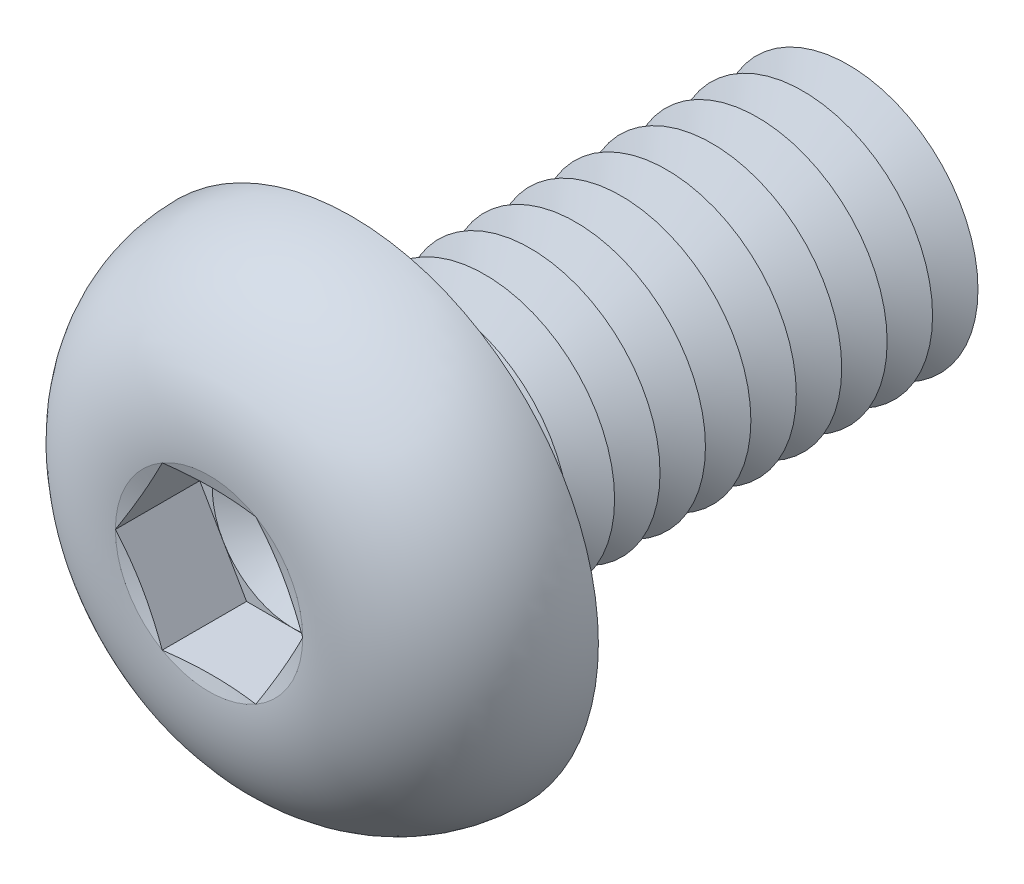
ISO-10303-21;
HEADER;
FILE_DESCRIPTION(('STEP AP214'),'2;1');
FILE_NAME('part.step','',(''),(''),'','','');
FILE_SCHEMA(('AUTOMOTIVE_DESIGN { 1 0 10303 214 1 1 1 1 }'));
ENDSEC;
DATA;
#1=APPLICATION_CONTEXT('core data for automotive mechanical design processes');
#2=APPLICATION_PROTOCOL_DEFINITION('international standard','automotive_design',2000,#1);
#3=PRODUCT_CONTEXT('',#1,'mechanical');
#4=PRODUCT('Part','Part','',(#3));
#5=PRODUCT_RELATED_PRODUCT_CATEGORY('part','',(#4));
#6=PRODUCT_DEFINITION_FORMATION('','',#4);
#7=PRODUCT_DEFINITION_CONTEXT('part definition',#1,'design');
#8=PRODUCT_DEFINITION('design','',#6,#7);
#9=PRODUCT_DEFINITION_SHAPE('','',#8);
#10=(LENGTH_UNIT() NAMED_UNIT(*) SI_UNIT(.MILLI.,.METRE.));
#11=(NAMED_UNIT(*) PLANE_ANGLE_UNIT() SI_UNIT($,.RADIAN.));
#12=(NAMED_UNIT(*) SI_UNIT($,.STERADIAN.) SOLID_ANGLE_UNIT());
#13=UNCERTAINTY_MEASURE_WITH_UNIT(LENGTH_MEASURE(1.E-05),#10,'distance_accuracy_value','');
#14=(GEOMETRIC_REPRESENTATION_CONTEXT(3) GLOBAL_UNCERTAINTY_ASSIGNED_CONTEXT((#13)) GLOBAL_UNIT_ASSIGNED_CONTEXT((#10,
#11,#12)) REPRESENTATION_CONTEXT('',''));
#15=CARTESIAN_POINT('',(0.,0.,0.));
#16=DIRECTION('',(0.,0.,1.));
#17=DIRECTION('',(1.,0.,0.));
#18=AXIS2_PLACEMENT_3D('',#15,#16,#17);
#19=CARTESIAN_POINT('',(0.,0.,0.9));
#20=DIRECTION('',(0.,0.,1.));
#21=DIRECTION('',(1.,0.,0.));
#22=AXIS2_PLACEMENT_3D('',#19,#20,#21);
#23=PLANE('',#22);
#24=CARTESIAN_POINT('',(0.,0.,0.9));
#25=DIRECTION('',(0.,0.,1.));
#26=DIRECTION('',(1.,0.,0.));
#27=AXIS2_PLACEMENT_3D('',#24,#25,#26);
#28=CIRCLE('',#27,1.24999941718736);
#29=CARTESIAN_POINT('',(1.08253125,0.624999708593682,0.9));
#30=VERTEX_POINT('',#29);
#31=CARTESIAN_POINT('',(0.,1.24999941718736,0.9));
#32=VERTEX_POINT('',#31);
#33=EDGE_CURVE('E118',#30,#32,#28,.T.);
#34=ORIENTED_EDGE('',*,*,#33,.F.);
#35=DIRECTION('',(-0.5,0.866025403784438,0.));
#36=VECTOR('',#35,1.);
#37=CARTESIAN_POINT('',(1.443375,0.,0.9));
#38=LINE('',#37,#36);
#39=CARTESIAN_POINT('',(0.7216875,1.24999941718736,0.9));
#40=VERTEX_POINT('',#39);
#41=EDGE_CURVE('E125',#30,#40,#38,.T.);
#42=ORIENTED_EDGE('',*,*,#41,.T.);
#43=DIRECTION('',(-1.,0.,0.));
#44=VECTOR('',#43,1.);
#45=CARTESIAN_POINT('',(0.7216875,1.24999941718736,0.9));
#46=LINE('',#45,#44);
#47=EDGE_CURVE('E136',#40,#32,#46,.T.);
#48=ORIENTED_EDGE('',*,*,#47,.T.);
#49=EDGE_LOOP('',(#34,#42,#48));
#50=FACE_BOUND('',#49,.T.);
#51=ADVANCED_FACE('F39',(#50),#23,.T.);
#52=CARTESIAN_POINT('',(0.,0.,0.9));
#53=DIRECTION('',(0.,0.,1.));
#54=DIRECTION('',(1.,0.,0.));
#55=AXIS2_PLACEMENT_3D('',#52,#53,#54);
#56=CIRCLE('',#55,1.24999941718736);
#57=CARTESIAN_POINT('',(-1.08253125,0.624999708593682,0.9));
#58=VERTEX_POINT('',#57);
#59=EDGE_CURVE('E11',#32,#58,#56,.T.);
#60=ORIENTED_EDGE('',*,*,#59,.F.);
#61=CARTESIAN_POINT('',(-0.721687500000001,1.24999941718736,0.9));
#62=VERTEX_POINT('',#61);
#63=EDGE_CURVE('E131',#32,#62,#46,.T.);
#64=ORIENTED_EDGE('',*,*,#63,.T.);
#65=DIRECTION('',(-0.5,-0.866025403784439,0.));
#66=VECTOR('',#65,1.);
#67=CARTESIAN_POINT('',(-0.721687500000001,1.24999941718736,0.9));
#68=LINE('',#67,#66);
#69=EDGE_CURVE('E134',#62,#58,#68,.T.);
#70=ORIENTED_EDGE('',*,*,#69,.T.);
#71=EDGE_LOOP('',(#60,#64,#70));
#72=FACE_BOUND('',#71,.T.);
#73=ADVANCED_FACE('F130',(#72),#23,.T.);
#74=CARTESIAN_POINT('',(-1.08253125,-0.624999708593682,0.9));
#75=VERTEX_POINT('',#74);
#76=EDGE_CURVE('E49',#58,#75,#56,.T.);
#77=ORIENTED_EDGE('',*,*,#76,.F.);
#78=CARTESIAN_POINT('',(-1.443375,0.,0.9));
#79=VERTEX_POINT('',#78);
#80=EDGE_CURVE('E143',#58,#79,#68,.T.);
#81=ORIENTED_EDGE('',*,*,#80,.T.);
#82=DIRECTION('',(0.5,-0.866025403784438,0.));
#83=VECTOR('',#82,1.);
#84=CARTESIAN_POINT('',(-1.443375,0.,0.9));
#85=LINE('',#84,#83);
#86=EDGE_CURVE('E152',#79,#75,#85,.T.);
#87=ORIENTED_EDGE('',*,*,#86,.T.);
#88=EDGE_LOOP('',(#77,#81,#87));
#89=FACE_BOUND('',#88,.T.);
#90=ADVANCED_FACE('F360',(#89),#23,.T.);
#91=CARTESIAN_POINT('',(0.,-1.24999941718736,0.9));
#92=VERTEX_POINT('',#91);
#93=EDGE_CURVE('E345',#75,#92,#56,.T.);
#94=ORIENTED_EDGE('',*,*,#93,.F.);
#95=CARTESIAN_POINT('',(-0.721687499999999,-1.24999941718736,0.9));
#96=VERTEX_POINT('',#95);
#97=EDGE_CURVE('E151',#75,#96,#85,.T.);
#98=ORIENTED_EDGE('',*,*,#97,.T.);
#99=DIRECTION('',(1.,0.,0.));
#100=VECTOR('',#99,1.);
#101=CARTESIAN_POINT('',(-0.721687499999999,-1.24999941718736,0.9));
#102=LINE('',#101,#100);
#103=EDGE_CURVE('E157',#96,#92,#102,.T.);
#104=ORIENTED_EDGE('',*,*,#103,.T.);
#105=EDGE_LOOP('',(#94,#98,#104));
#106=FACE_BOUND('',#105,.T.);
#107=ADVANCED_FACE('F353',(#106),#23,.T.);
#108=CARTESIAN_POINT('',(1.08253125,-0.624999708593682,0.9));
#109=VERTEX_POINT('',#108);
#110=EDGE_CURVE('E56',#92,#109,#56,.T.);
#111=ORIENTED_EDGE('',*,*,#110,.F.);
#112=CARTESIAN_POINT('',(0.721687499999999,-1.24999941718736,0.9));
#113=VERTEX_POINT('',#112);
#114=EDGE_CURVE('E156',#92,#113,#102,.T.);
#115=ORIENTED_EDGE('',*,*,#114,.T.);
#116=DIRECTION('',(0.5,0.866025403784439,0.));
#117=VECTOR('',#116,1.);
#118=CARTESIAN_POINT('',(0.721687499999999,-1.24999941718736,0.9));
#119=LINE('',#118,#117);
#120=EDGE_CURVE('E162',#113,#109,#119,.T.);
#121=ORIENTED_EDGE('',*,*,#120,.T.);
#122=EDGE_LOOP('',(#111,#115,#121));
#123=FACE_BOUND('',#122,.T.);
#124=ADVANCED_FACE('F421',(#123),#23,.T.);
#125=CARTESIAN_POINT('',(0.,0.,2.2));
#126=DIRECTION('',(0.,0.,1.));
#127=DIRECTION('',(1.,0.,0.));
#128=AXIS2_PLACEMENT_3D('',#125,#126,#127);
#129=CONICAL_SURFACE('',#128,1.443375,1.30899693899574);
#130=CARTESIAN_POINT('',(1.44349047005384,-0.000199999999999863,2.20003094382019));
#131=CARTESIAN_POINT('',(1.41351104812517,0.0517258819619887,2.19199301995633));
#132=CARTESIAN_POINT('',(1.38347725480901,0.10374593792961,2.18469579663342));
#133=CARTESIAN_POINT('',(1.32330355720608,0.207969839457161,2.17187512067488));
#134=CARTESIAN_POINT('',(1.29316361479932,0.260173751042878,2.16635238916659));
#135=CARTESIAN_POINT('',(1.23296043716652,0.364448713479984,2.15740323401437));
#136=CARTESIAN_POINT('',(1.20289760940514,0.416519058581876,2.15396613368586));
#137=CARTESIAN_POINT('',(1.14273359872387,0.520726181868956,2.14935732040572));
#138=CARTESIAN_POINT('',(1.11263242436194,0.572862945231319,2.14818516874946));
#139=CARTESIAN_POINT('',(1.05243007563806,0.677136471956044,2.14818516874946));
#140=CARTESIAN_POINT('',(1.02232890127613,0.729273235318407,2.14935732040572));
#141=CARTESIAN_POINT('',(0.962164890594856,0.833480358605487,2.15396613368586));
#142=CARTESIAN_POINT('',(0.932102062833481,0.885550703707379,2.15740323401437));
#143=CARTESIAN_POINT('',(0.87189888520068,0.989825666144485,2.16635238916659));
#144=CARTESIAN_POINT('',(0.841758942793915,1.0420295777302,2.17187512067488));
#145=CARTESIAN_POINT('',(0.781585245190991,1.14625347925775,2.18469579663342));
#146=CARTESIAN_POINT('',(0.751551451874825,1.19827353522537,2.19199301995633));
#147=CARTESIAN_POINT('',(0.721572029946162,1.25019941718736,2.20003094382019));
#148=B_SPLINE_CURVE_WITH_KNOTS('',3,(#130,#131,#132,#133,#134,#135,#136,#137,#138,#139,#140,
#141,#142,#143,#144,#145,#146,#147),.UNSPECIFIED.,.F.,.F.,(4,2,2,2,2,2,2,2,4),(0.,
0.181495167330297,0.363063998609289,0.543695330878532,0.724291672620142,0.904888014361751,
1.08551934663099,1.26708817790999,1.44858334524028),.UNSPECIFIED.);
#149=CARTESIAN_POINT('',(1.443375,0.,2.2));
#150=VERTEX_POINT('',#149);
#151=CARTESIAN_POINT('',(0.721687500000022,1.24999941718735,2.2));
#152=VERTEX_POINT('',#151);
#153=EDGE_CURVE('E222',#150,#152,#148,.T.);
#154=ORIENTED_EDGE('',*,*,#153,.F.);
#155=CARTESIAN_POINT('',(0.,0.,2.2));
#156=DIRECTION('',(0.,0.,-1.));
#157=DIRECTION('',(-1.,0.,0.));
#158=AXIS2_PLACEMENT_3D('',#155,#156,#157);
#159=CIRCLE('',#158,1.443375);
#160=EDGE_CURVE('E390',#152,#150,#159,.T.);
#161=ORIENTED_EDGE('',*,*,#160,.F.);
#162=EDGE_LOOP('',(#154,#161));
#163=FACE_BOUND('',#162,.T.);
#164=ADVANCED_FACE('F410',(#163),#129,.F.);
#165=CARTESIAN_POINT('',(0.721572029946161,-1.25019941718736,2.20003094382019));
#166=CARTESIAN_POINT('',(0.751551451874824,-1.19827353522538,2.19199301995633));
#167=CARTESIAN_POINT('',(0.78158524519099,-1.14625347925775,2.18469579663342));
#168=CARTESIAN_POINT('',(0.841758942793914,-1.0420295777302,2.17187512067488));
#169=CARTESIAN_POINT('',(0.87189888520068,-0.989825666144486,2.16635238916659));
#170=CARTESIAN_POINT('',(0.932102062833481,-0.88555070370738,2.15740323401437));
#171=CARTESIAN_POINT('',(0.962164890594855,-0.833480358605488,2.15396613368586));
#172=CARTESIAN_POINT('',(1.02232890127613,-0.729273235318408,2.14935732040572));
#173=CARTESIAN_POINT('',(1.05243007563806,-0.677136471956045,2.14818516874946));
#174=CARTESIAN_POINT('',(1.11263242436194,-0.572862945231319,2.14818516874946));
#175=CARTESIAN_POINT('',(1.14273359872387,-0.520726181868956,2.14935732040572));
#176=CARTESIAN_POINT('',(1.20289760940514,-0.416519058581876,2.15396613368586));
#177=CARTESIAN_POINT('',(1.23296043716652,-0.364448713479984,2.15740323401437));
#178=CARTESIAN_POINT('',(1.29316361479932,-0.260173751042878,2.16635238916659));
#179=CARTESIAN_POINT('',(1.32330355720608,-0.207969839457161,2.17187512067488));
#180=CARTESIAN_POINT('',(1.38347725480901,-0.10374593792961,2.18469579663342));
#181=CARTESIAN_POINT('',(1.41351104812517,-0.0517258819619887,2.19199301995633));
#182=CARTESIAN_POINT('',(1.44349047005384,0.000199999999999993,2.20003094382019));
#183=B_SPLINE_CURVE_WITH_KNOTS('',3,(#165,#166,#167,#168,#169,#170,#171,#172,#173,#174,#175,
#176,#177,#178,#179,#180,#181,#182),.UNSPECIFIED.,.F.,.F.,(4,2,2,2,2,2,2,2,4),(0.,
0.181495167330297,0.36306399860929,0.543695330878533,0.724291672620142,0.904888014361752,
1.085519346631,1.26708817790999,1.44858334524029),.UNSPECIFIED.);
#184=CARTESIAN_POINT('',(0.721687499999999,-1.24999941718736,2.2));
#185=VERTEX_POINT('',#184);
#186=EDGE_CURVE('E231',#185,#150,#183,.T.);
#187=ORIENTED_EDGE('',*,*,#186,.F.);
#188=EDGE_CURVE('E392',#150,#185,#159,.T.);
#189=ORIENTED_EDGE('',*,*,#188,.F.);
#190=EDGE_LOOP('',(#187,#189));
#191=FACE_BOUND('',#190,.T.);
#192=ADVANCED_FACE('F412',(#191),#129,.F.);
#193=CARTESIAN_POINT('',(-2.17815859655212,-1.24999941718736,2.48616275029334));
#194=CARTESIAN_POINT('',(-2.07269794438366,-1.24999941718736,2.4616881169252));
#195=CARTESIAN_POINT('',(-1.96714913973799,-1.24999941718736,2.43756889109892));
#196=CARTESIAN_POINT('',(-1.75576352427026,-1.24999941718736,2.39052699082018));
#197=CARTESIAN_POINT('',(-1.64992665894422,-1.24999941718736,2.36760456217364));
#198=CARTESIAN_POINT('',(-1.43690237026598,-1.24999941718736,2.3232454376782));
#199=CARTESIAN_POINT('',(-1.32971158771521,-1.24999941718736,2.30182468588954));
#200=CARTESIAN_POINT('',(-1.1148274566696,-1.24999941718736,2.26156703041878));
#201=CARTESIAN_POINT('',(-1.00713406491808,-1.24999941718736,2.24273035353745));
#202=CARTESIAN_POINT('',(-0.794044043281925,-1.24999941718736,2.2093913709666));
#203=CARTESIAN_POINT('',(-0.688664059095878,-1.24999941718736,2.19478562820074));
#204=CARTESIAN_POINT('',(-0.477310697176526,-1.24999941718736,2.17085809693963));
#205=CARTESIAN_POINT('',(-0.371337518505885,-1.24999941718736,2.16153463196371));
#206=CARTESIAN_POINT('',(-0.159455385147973,-1.24999941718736,2.14976770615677));
#207=CARTESIAN_POINT('',(-0.0535482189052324,-1.24999941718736,2.14729400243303));
#208=CARTESIAN_POINT('',(0.158189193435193,-1.24999941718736,2.14966287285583));
#209=CARTESIAN_POINT('',(0.264019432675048,-1.24999941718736,2.15450603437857));
#210=CARTESIAN_POINT('',(0.445148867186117,-1.24999941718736,2.16825380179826));
#211=CARTESIAN_POINT('',(0.520574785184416,-1.24999941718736,2.17561242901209));
#212=CARTESIAN_POINT('',(0.671115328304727,-1.24999941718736,2.19297000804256));
#213=CARTESIAN_POINT('',(0.746229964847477,-1.24999941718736,2.20296886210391));
#214=CARTESIAN_POINT('',(0.896387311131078,-1.24999941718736,2.22505910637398));
#215=CARTESIAN_POINT('',(0.971429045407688,-1.24999941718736,2.23715700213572));
#216=CARTESIAN_POINT('',(1.12124320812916,-1.24999941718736,2.26292371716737));
#217=CARTESIAN_POINT('',(1.19601562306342,-1.24999941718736,2.27659261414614));
#218=CARTESIAN_POINT('',(1.34686913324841,-1.24999941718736,2.30540811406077));
#219=CARTESIAN_POINT('',(1.42294548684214,-1.24999941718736,2.32057934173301));
#220=CARTESIAN_POINT('',(1.57490676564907,-1.24999941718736,2.351851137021));
#221=CARTESIAN_POINT('',(1.65079168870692,-1.24999941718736,2.36795171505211));
#222=CARTESIAN_POINT('',(1.80199501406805,-1.24999941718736,2.40076814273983));
#223=CARTESIAN_POINT('',(1.87731425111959,-1.24999941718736,2.41748016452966));
#224=CARTESIAN_POINT('',(2.02782424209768,-1.24999941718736,2.45144971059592));
#225=CARTESIAN_POINT('',(2.10301500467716,-1.24999941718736,2.46870719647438));
#226=CARTESIAN_POINT('',(2.17815859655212,-1.24999941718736,2.48616275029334));
#227=B_SPLINE_CURVE_WITH_KNOTS('',3,(#193,#194,#195,#196,#197,#198,#199,#200,#201,#202,#203,
#204,#205,#206,#207,#208,#209,#210,#211,#212,#213,#214,#215,#216,#217,#218,#219,#220,#221,#222,
#223,#224,#225,#226),.UNSPECIFIED.,.F.,.F.,(4,2,2,2,2,2,2,2,2,2,2,2,2,2,2,2,4),(0.,
0.324797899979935,0.649662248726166,0.977572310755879,1.30551113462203,1.62458166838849,
1.94355087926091,2.26110952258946,2.57869365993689,2.80599541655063,3.03328875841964,
3.2612995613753,3.48932164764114,3.7220371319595,3.95475522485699,4.18620606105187,
4.41764064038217),.UNSPECIFIED.);
#228=CARTESIAN_POINT('',(-0.721687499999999,-1.24999941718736,2.2));
#229=VERTEX_POINT('',#228);
#230=EDGE_CURVE('E372',#229,#185,#227,.T.);
#231=ORIENTED_EDGE('',*,*,#230,.F.);
#232=EDGE_CURVE('E380',#185,#229,#159,.T.);
#233=ORIENTED_EDGE('',*,*,#232,.F.);
#234=EDGE_LOOP('',(#231,#233));
#235=FACE_BOUND('',#234,.T.);
#236=ADVANCED_FACE('F415',(#235),#129,.F.);
#237=CARTESIAN_POINT('',(-1.44349047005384,0.000200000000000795,2.20003094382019));
#238=CARTESIAN_POINT('',(-1.41351104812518,-0.0517258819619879,2.19199301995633));
#239=CARTESIAN_POINT('',(-1.38347725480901,-0.10374593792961,2.18469579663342));
#240=CARTESIAN_POINT('',(-1.32330355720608,-0.20796983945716,2.17187512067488));
#241=CARTESIAN_POINT('',(-1.29316361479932,-0.260173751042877,2.16635238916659));
#242=CARTESIAN_POINT('',(-1.23296043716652,-0.364448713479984,2.15740323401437));
#243=CARTESIAN_POINT('',(-1.20289760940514,-0.416519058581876,2.15396613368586));
#244=CARTESIAN_POINT('',(-1.14273359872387,-0.520726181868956,2.14935732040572));
#245=CARTESIAN_POINT('',(-1.11263242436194,-0.572862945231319,2.14818516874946));
#246=CARTESIAN_POINT('',(-1.05243007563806,-0.677136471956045,2.14818516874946));
#247=CARTESIAN_POINT('',(-1.02232890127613,-0.729273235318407,2.14935732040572));
#248=CARTESIAN_POINT('',(-0.962164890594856,-0.833480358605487,2.15396613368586));
#249=CARTESIAN_POINT('',(-0.932102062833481,-0.885550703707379,2.15740323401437));
#250=CARTESIAN_POINT('',(-0.87189888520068,-0.989825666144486,2.16635238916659));
#251=CARTESIAN_POINT('',(-0.841758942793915,-1.0420295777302,2.17187512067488));
#252=CARTESIAN_POINT('',(-0.78158524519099,-1.14625347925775,2.18469579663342));
#253=CARTESIAN_POINT('',(-0.751551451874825,-1.19827353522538,2.19199301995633));
#254=CARTESIAN_POINT('',(-0.721572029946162,-1.25019941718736,2.20003094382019));
#255=B_SPLINE_CURVE_WITH_KNOTS('',3,(#237,#238,#239,#240,#241,#242,#243,#244,#245,#246,#247,
#248,#249,#250,#251,#252,#253,#254),.UNSPECIFIED.,.F.,.F.,(4,2,2,2,2,2,2,2,4),(0.,
0.181495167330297,0.36306399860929,0.543695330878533,0.724291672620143,0.904888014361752,
1.085519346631,1.26708817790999,1.44858334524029),.UNSPECIFIED.);
#256=CARTESIAN_POINT('',(-1.443375,0.,2.2));
#257=VERTEX_POINT('',#256);
#258=EDGE_CURVE('E365',#257,#229,#255,.T.);
#259=ORIENTED_EDGE('',*,*,#258,.F.);
#260=EDGE_CURVE('E325',#229,#257,#159,.T.);
#261=ORIENTED_EDGE('',*,*,#260,.F.);
#262=EDGE_LOOP('',(#259,#261));
#263=FACE_BOUND('',#262,.T.);
#264=ADVANCED_FACE('F369',(#263),#129,.F.);
#265=CARTESIAN_POINT('',(-0.721572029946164,1.25019941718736,2.20003094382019));
#266=CARTESIAN_POINT('',(-0.751551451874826,1.19827353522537,2.19199301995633));
#267=CARTESIAN_POINT('',(-0.781585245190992,1.14625347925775,2.18469579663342));
#268=CARTESIAN_POINT('',(-0.841758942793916,1.0420295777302,2.17187512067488));
#269=CARTESIAN_POINT('',(-0.871898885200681,0.989825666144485,2.16635238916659));
#270=CARTESIAN_POINT('',(-0.932102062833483,0.885550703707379,2.15740323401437));
#271=CARTESIAN_POINT('',(-0.962164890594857,0.833480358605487,2.15396613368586));
#272=CARTESIAN_POINT('',(-1.02232890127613,0.729273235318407,2.14935732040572));
#273=CARTESIAN_POINT('',(-1.05243007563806,0.677136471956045,2.14818516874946));
#274=CARTESIAN_POINT('',(-1.11263242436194,0.572862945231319,2.14818516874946));
#275=CARTESIAN_POINT('',(-1.14273359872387,0.520726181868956,2.14935732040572));
#276=CARTESIAN_POINT('',(-1.20289760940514,0.416519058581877,2.15396613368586));
#277=CARTESIAN_POINT('',(-1.23296043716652,0.364448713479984,2.15740323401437));
#278=CARTESIAN_POINT('',(-1.29316361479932,0.260173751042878,2.16635238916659));
#279=CARTESIAN_POINT('',(-1.32330355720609,0.207969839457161,2.17187512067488));
#280=CARTESIAN_POINT('',(-1.38347725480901,0.103745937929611,2.18469579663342));
#281=CARTESIAN_POINT('',(-1.41351104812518,0.0517258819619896,2.19199301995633));
#282=CARTESIAN_POINT('',(-1.44349047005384,-0.00019999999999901,2.20003094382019));
#283=B_SPLINE_CURVE_WITH_KNOTS('',3,(#265,#266,#267,#268,#269,#270,#271,#272,#273,#274,#275,
#276,#277,#278,#279,#280,#281,#282),.UNSPECIFIED.,.F.,.F.,(4,2,2,2,2,2,2,2,4),(0.,
0.181495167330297,0.363063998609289,0.543695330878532,0.724291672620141,0.90488801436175,
1.08551934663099,1.26708817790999,1.44858334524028),.UNSPECIFIED.);
#284=CARTESIAN_POINT('',(-0.721687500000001,1.24999941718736,2.2));
#285=VERTEX_POINT('',#284);
#286=EDGE_CURVE('E195',#285,#257,#283,.T.);
#287=ORIENTED_EDGE('',*,*,#286,.F.);
#288=EDGE_CURVE('E326',#257,#285,#159,.T.);
#289=ORIENTED_EDGE('',*,*,#288,.F.);
#290=EDGE_LOOP('',(#287,#289));
#291=FACE_BOUND('',#290,.T.);
#292=ADVANCED_FACE('F383',(#291),#129,.F.);
#293=CARTESIAN_POINT('',(0.,0.,-5.55));
#294=DIRECTION('',(0.,0.,1.));
#295=DIRECTION('',(1.,0.,0.));
#296=AXIS2_PLACEMENT_3D('',#293,#294,#295);
#297=CONICAL_SURFACE('',#296,2.,1.0471975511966);
#298=CARTESIAN_POINT('',(0.,0.,-5.9));
#299=DIRECTION('',(0.,0.,1.));
#300=DIRECTION('',(1.,0.,0.));
#301=AXIS2_PLACEMENT_3D('',#298,#299,#300);
#302=CIRCLE('',#301,1.3937822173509);
#303=CARTESIAN_POINT('',(1.3937822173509,0.,-5.9));
#304=VERTEX_POINT('',#303);
#305=EDGE_CURVE('E297',#304,#304,#302,.T.);
#306=ORIENTED_EDGE('',*,*,#305,.T.);
#307=EDGE_LOOP('',(#306));
#308=FACE_BOUND('',#307,.T.);
#309=CARTESIAN_POINT('',(0.,0.,-5.55));
#310=DIRECTION('',(0.,0.,1.));
#311=DIRECTION('',(1.,0.,0.));
#312=AXIS2_PLACEMENT_3D('',#309,#310,#311);
#313=CIRCLE('',#312,2.);
#314=CARTESIAN_POINT('',(2.,0.,-5.55));
#315=VERTEX_POINT('',#314);
#316=EDGE_CURVE('E293',#315,#315,#313,.T.);
#317=ORIENTED_EDGE('',*,*,#316,.F.);
#318=EDGE_LOOP('',(#317));
#319=FACE_BOUND('',#318,.T.);
#320=ADVANCED_FACE('F477',(#308,#319),#297,.T.);
#321=CARTESIAN_POINT('',(0.,0.,-5.9));
#322=DIRECTION('',(0.,0.,-1.));
#323=DIRECTION('',(-1.,0.,0.));
#324=AXIS2_PLACEMENT_3D('',#321,#322,#323);
#325=CONICAL_SURFACE('',#324,1.3937822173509,1.0471975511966);
#326=CARTESIAN_POINT('',(0.,0.,-6.25));
#327=DIRECTION('',(0.,0.,1.));
#328=DIRECTION('',(1.,0.,0.));
#329=AXIS2_PLACEMENT_3D('',#326,#327,#328);
#330=CIRCLE('',#329,2.);
#331=CARTESIAN_POINT('',(2.,0.,-6.25));
#332=VERTEX_POINT('',#331);
#333=EDGE_CURVE('E301',#332,#332,#330,.T.);
#334=ORIENTED_EDGE('',*,*,#333,.T.);
#335=EDGE_LOOP('',(#334));
#336=FACE_BOUND('',#335,.T.);
#337=ORIENTED_EDGE('',*,*,#305,.F.);
#338=EDGE_LOOP('',(#337));
#339=FACE_BOUND('',#338,.T.);
#340=ADVANCED_FACE('F485',(#336,#339),#325,.T.);
#341=CARTESIAN_POINT('',(0.,2.,-8.));
#342=DIRECTION('',(0.,0.,-1.));
#343=DIRECTION('',(-1.,0.,0.));
#344=AXIS2_PLACEMENT_3D('',#341,#342,#343);
#345=PLANE('',#344);
#346=CARTESIAN_POINT('',(0.,0.,-8.));
#347=DIRECTION('',(0.,0.,1.));
#348=DIRECTION('',(1.,0.,0.));
#349=AXIS2_PLACEMENT_3D('',#346,#347,#348);
#350=CIRCLE('',#349,1.3937822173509);
#351=CARTESIAN_POINT('',(1.3937822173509,0.,-8.));
#352=VERTEX_POINT('',#351);
#353=EDGE_CURVE('E321',#352,#352,#350,.T.);
#354=ORIENTED_EDGE('',*,*,#353,.F.);
#355=EDGE_LOOP('',(#354));
#356=FACE_BOUND('',#355,.T.);
#357=ADVANCED_FACE('F495',(#356),#345,.T.);
#358=CARTESIAN_POINT('',(0.,0.,-7.65));
#359=DIRECTION('',(0.,0.,1.));
#360=DIRECTION('',(1.,0.,0.));
#361=AXIS2_PLACEMENT_3D('',#358,#359,#360);
#362=CONICAL_SURFACE('',#361,2.,1.0471975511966);
#363=ORIENTED_EDGE('',*,*,#353,.T.);
#364=EDGE_LOOP('',(#363));
#365=FACE_BOUND('',#364,.T.);
#366=CARTESIAN_POINT('',(0.,0.,-7.65));
#367=DIRECTION('',(0.,0.,1.));
#368=DIRECTION('',(1.,0.,0.));
#369=AXIS2_PLACEMENT_3D('',#366,#367,#368);
#370=CIRCLE('',#369,2.);
#371=CARTESIAN_POINT('',(2.,0.,-7.65));
#372=VERTEX_POINT('',#371);
#373=EDGE_CURVE('E317',#372,#372,#370,.T.);
#374=ORIENTED_EDGE('',*,*,#373,.F.);
#375=EDGE_LOOP('',(#374));
#376=FACE_BOUND('',#375,.T.);
#377=ADVANCED_FACE('F504',(#365,#376),#362,.T.);
#378=CARTESIAN_POINT('',(0.,0.,-7.3));
#379=DIRECTION('',(0.,0.,-1.));
#380=DIRECTION('',(-1.,0.,0.));
#381=AXIS2_PLACEMENT_3D('',#378,#379,#380);
#382=CONICAL_SURFACE('',#381,1.3937822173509,1.0471975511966);
#383=ORIENTED_EDGE('',*,*,#373,.T.);
#384=EDGE_LOOP('',(#383));
#385=FACE_BOUND('',#384,.T.);
#386=CARTESIAN_POINT('',(0.,0.,-7.3));
#387=DIRECTION('',(0.,0.,1.));
#388=DIRECTION('',(1.,0.,0.));
#389=AXIS2_PLACEMENT_3D('',#386,#387,#388);
#390=CIRCLE('',#389,1.3937822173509);
#391=CARTESIAN_POINT('',(1.3937822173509,0.,-7.3));
#392=VERTEX_POINT('',#391);
#393=EDGE_CURVE('E313',#392,#392,#390,.T.);
#394=ORIENTED_EDGE('',*,*,#393,.F.);
#395=EDGE_LOOP('',(#394));
#396=FACE_BOUND('',#395,.T.);
#397=ADVANCED_FACE('F512',(#385,#396),#382,.T.);
#398=CARTESIAN_POINT('',(0.,0.,-6.95));
#399=DIRECTION('',(0.,0.,1.));
#400=DIRECTION('',(1.,0.,0.));
#401=AXIS2_PLACEMENT_3D('',#398,#399,#400);
#402=CONICAL_SURFACE('',#401,2.,1.0471975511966);
#403=ORIENTED_EDGE('',*,*,#393,.T.);
#404=EDGE_LOOP('',(#403));
#405=FACE_BOUND('',#404,.T.);
#406=CARTESIAN_POINT('',(0.,0.,-6.95));
#407=DIRECTION('',(0.,0.,1.));
#408=DIRECTION('',(1.,0.,0.));
#409=AXIS2_PLACEMENT_3D('',#406,#407,#408);
#410=CIRCLE('',#409,2.);
#411=CARTESIAN_POINT('',(2.,0.,-6.95));
#412=VERTEX_POINT('',#411);
#413=EDGE_CURVE('E309',#412,#412,#410,.T.);
#414=ORIENTED_EDGE('',*,*,#413,.F.);
#415=EDGE_LOOP('',(#414));
#416=FACE_BOUND('',#415,.T.);
#417=ADVANCED_FACE('F521',(#405,#416),#402,.T.);
#418=CARTESIAN_POINT('',(0.,0.,-6.6));
#419=DIRECTION('',(0.,0.,-1.));
#420=DIRECTION('',(-1.,0.,0.));
#421=AXIS2_PLACEMENT_3D('',#418,#419,#420);
#422=CONICAL_SURFACE('',#421,1.3937822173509,1.0471975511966);
#423=ORIENTED_EDGE('',*,*,#413,.T.);
#424=EDGE_LOOP('',(#423));
#425=FACE_BOUND('',#424,.T.);
#426=CARTESIAN_POINT('',(0.,0.,-6.6));
#427=DIRECTION('',(0.,0.,1.));
#428=DIRECTION('',(1.,0.,0.));
#429=AXIS2_PLACEMENT_3D('',#426,#427,#428);
#430=CIRCLE('',#429,1.3937822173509);
#431=CARTESIAN_POINT('',(1.3937822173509,0.,-6.6));
#432=VERTEX_POINT('',#431);
#433=EDGE_CURVE('E305',#432,#432,#430,.T.);
#434=ORIENTED_EDGE('',*,*,#433,.F.);
#435=EDGE_LOOP('',(#434));
#436=FACE_BOUND('',#435,.T.);
#437=ADVANCED_FACE('F530',(#425,#436),#422,.T.);
#438=CARTESIAN_POINT('',(0.,0.,-6.25));
#439=DIRECTION('',(0.,0.,1.));
#440=DIRECTION('',(1.,0.,0.));
#441=AXIS2_PLACEMENT_3D('',#438,#439,#440);
#442=CONICAL_SURFACE('',#441,2.,1.0471975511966);
#443=ORIENTED_EDGE('',*,*,#433,.T.);
#444=EDGE_LOOP('',(#443));
#445=FACE_BOUND('',#444,.T.);
#446=ORIENTED_EDGE('',*,*,#333,.F.);
#447=EDGE_LOOP('',(#446));
#448=FACE_BOUND('',#447,.T.);
#449=ADVANCED_FACE('F539',(#445,#448),#442,.T.);
#450=CARTESIAN_POINT('',(0.,0.,-4.85));
#451=DIRECTION('',(0.,0.,1.));
#452=DIRECTION('',(1.,0.,0.));
#453=AXIS2_PLACEMENT_3D('',#450,#451,#452);
#454=CONICAL_SURFACE('',#453,2.,1.0471975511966);
#455=CARTESIAN_POINT('',(0.,0.,-5.2));
#456=DIRECTION('',(0.,0.,1.));
#457=DIRECTION('',(1.,0.,0.));
#458=AXIS2_PLACEMENT_3D('',#455,#456,#457);
#459=CIRCLE('',#458,1.3937822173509);
#460=CARTESIAN_POINT('',(1.3937822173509,0.,-5.2));
#461=VERTEX_POINT('',#460);
#462=EDGE_CURVE('E289',#461,#461,#459,.T.);
#463=ORIENTED_EDGE('',*,*,#462,.T.);
#464=EDGE_LOOP('',(#463));
#465=FACE_BOUND('',#464,.T.);
#466=CARTESIAN_POINT('',(0.,0.,-4.85));
#467=DIRECTION('',(0.,0.,1.));
#468=DIRECTION('',(1.,0.,0.));
#469=AXIS2_PLACEMENT_3D('',#466,#467,#468);
#470=CIRCLE('',#469,2.);
#471=CARTESIAN_POINT('',(2.,0.,-4.85));
#472=VERTEX_POINT('',#471);
#473=EDGE_CURVE('E285',#472,#472,#470,.T.);
#474=ORIENTED_EDGE('',*,*,#473,.F.);
#475=EDGE_LOOP('',(#474));
#476=FACE_BOUND('',#475,.T.);
#477=ADVANCED_FACE('F548',(#465,#476),#454,.T.);
#478=CARTESIAN_POINT('',(0.,0.,-5.2));
#479=DIRECTION('',(0.,0.,-1.));
#480=DIRECTION('',(-1.,0.,0.));
#481=AXIS2_PLACEMENT_3D('',#478,#479,#480);
#482=CONICAL_SURFACE('',#481,1.3937822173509,1.0471975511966);
#483=ORIENTED_EDGE('',*,*,#316,.T.);
#484=EDGE_LOOP('',(#483));
#485=FACE_BOUND('',#484,.T.);
#486=ORIENTED_EDGE('',*,*,#462,.F.);
#487=EDGE_LOOP('',(#486));
#488=FACE_BOUND('',#487,.T.);
#489=ADVANCED_FACE('F557',(#485,#488),#482,.T.);
#490=CARTESIAN_POINT('',(0.,0.,-4.15));
#491=DIRECTION('',(0.,0.,1.));
#492=DIRECTION('',(1.,0.,0.));
#493=AXIS2_PLACEMENT_3D('',#490,#491,#492);
#494=CONICAL_SURFACE('',#493,2.,1.0471975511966);
#495=CARTESIAN_POINT('',(0.,0.,-4.5));
#496=DIRECTION('',(0.,0.,1.));
#497=DIRECTION('',(1.,0.,0.));
#498=AXIS2_PLACEMENT_3D('',#495,#496,#497);
#499=CIRCLE('',#498,1.3937822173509);
#500=CARTESIAN_POINT('',(1.3937822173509,0.,-4.5));
#501=VERTEX_POINT('',#500);
#502=EDGE_CURVE('E281',#501,#501,#499,.T.);
#503=ORIENTED_EDGE('',*,*,#502,.T.);
#504=EDGE_LOOP('',(#503));
#505=FACE_BOUND('',#504,.T.);
#506=CARTESIAN_POINT('',(0.,0.,-4.15));
#507=DIRECTION('',(0.,0.,1.));
#508=DIRECTION('',(1.,0.,0.));
#509=AXIS2_PLACEMENT_3D('',#506,#507,#508);
#510=CIRCLE('',#509,2.);
#511=CARTESIAN_POINT('',(2.,0.,-4.15));
#512=VERTEX_POINT('',#511);
#513=EDGE_CURVE('E277',#512,#512,#510,.T.);
#514=ORIENTED_EDGE('',*,*,#513,.F.);
#515=EDGE_LOOP('',(#514));
#516=FACE_BOUND('',#515,.T.);
#517=ADVANCED_FACE('F566',(#505,#516),#494,.T.);
#518=CARTESIAN_POINT('',(0.,0.,-4.5));
#519=DIRECTION('',(0.,0.,-1.));
#520=DIRECTION('',(-1.,0.,0.));
#521=AXIS2_PLACEMENT_3D('',#518,#519,#520);
#522=CONICAL_SURFACE('',#521,1.3937822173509,1.0471975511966);
#523=ORIENTED_EDGE('',*,*,#473,.T.);
#524=EDGE_LOOP('',(#523));
#525=FACE_BOUND('',#524,.T.);
#526=ORIENTED_EDGE('',*,*,#502,.F.);
#527=EDGE_LOOP('',(#526));
#528=FACE_BOUND('',#527,.T.);
#529=ADVANCED_FACE('F575',(#525,#528),#522,.T.);
#530=CARTESIAN_POINT('',(0.,0.,-3.45));
#531=DIRECTION('',(0.,0.,1.));
#532=DIRECTION('',(1.,0.,0.));
#533=AXIS2_PLACEMENT_3D('',#530,#531,#532);
#534=CONICAL_SURFACE('',#533,2.,1.0471975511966);
#535=CARTESIAN_POINT('',(0.,0.,-3.8));
#536=DIRECTION('',(0.,0.,1.));
#537=DIRECTION('',(1.,0.,0.));
#538=AXIS2_PLACEMENT_3D('',#535,#536,#537);
#539=CIRCLE('',#538,1.3937822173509);
#540=CARTESIAN_POINT('',(1.3937822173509,0.,-3.8));
#541=VERTEX_POINT('',#540);
#542=EDGE_CURVE('E273',#541,#541,#539,.T.);
#543=ORIENTED_EDGE('',*,*,#542,.T.);
#544=EDGE_LOOP('',(#543));
#545=FACE_BOUND('',#544,.T.);
#546=CARTESIAN_POINT('',(0.,0.,-3.45));
#547=DIRECTION('',(0.,0.,1.));
#548=DIRECTION('',(1.,0.,0.));
#549=AXIS2_PLACEMENT_3D('',#546,#547,#548);
#550=CIRCLE('',#549,2.);
#551=CARTESIAN_POINT('',(2.,0.,-3.45));
#552=VERTEX_POINT('',#551);
#553=EDGE_CURVE('E269',#552,#552,#550,.T.);
#554=ORIENTED_EDGE('',*,*,#553,.F.);
#555=EDGE_LOOP('',(#554));
#556=FACE_BOUND('',#555,.T.);
#557=ADVANCED_FACE('F584',(#545,#556),#534,.T.);
#558=CARTESIAN_POINT('',(0.,0.,-3.8));
#559=DIRECTION('',(0.,0.,-1.));
#560=DIRECTION('',(-1.,0.,0.));
#561=AXIS2_PLACEMENT_3D('',#558,#559,#560);
#562=CONICAL_SURFACE('',#561,1.3937822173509,1.0471975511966);
#563=ORIENTED_EDGE('',*,*,#513,.T.);
#564=EDGE_LOOP('',(#563));
#565=FACE_BOUND('',#564,.T.);
#566=ORIENTED_EDGE('',*,*,#542,.F.);
#567=EDGE_LOOP('',(#566));
#568=FACE_BOUND('',#567,.T.);
#569=ADVANCED_FACE('F593',(#565,#568),#562,.T.);
#570=CARTESIAN_POINT('',(0.,0.,-2.75));
#571=DIRECTION('',(0.,0.,1.));
#572=DIRECTION('',(1.,0.,0.));
#573=AXIS2_PLACEMENT_3D('',#570,#571,#572);
#574=CONICAL_SURFACE('',#573,2.,1.0471975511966);
#575=CARTESIAN_POINT('',(0.,0.,-3.1));
#576=DIRECTION('',(0.,0.,1.));
#577=DIRECTION('',(1.,0.,0.));
#578=AXIS2_PLACEMENT_3D('',#575,#576,#577);
#579=CIRCLE('',#578,1.3937822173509);
#580=CARTESIAN_POINT('',(1.3937822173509,0.,-3.1));
#581=VERTEX_POINT('',#580);
#582=EDGE_CURVE('E265',#581,#581,#579,.T.);
#583=ORIENTED_EDGE('',*,*,#582,.T.);
#584=EDGE_LOOP('',(#583));
#585=FACE_BOUND('',#584,.T.);
#586=CARTESIAN_POINT('',(0.,0.,-2.75));
#587=DIRECTION('',(0.,0.,1.));
#588=DIRECTION('',(1.,0.,0.));
#589=AXIS2_PLACEMENT_3D('',#586,#587,#588);
#590=CIRCLE('',#589,2.);
#591=CARTESIAN_POINT('',(2.,0.,-2.75));
#592=VERTEX_POINT('',#591);
#593=EDGE_CURVE('E261',#592,#592,#590,.T.);
#594=ORIENTED_EDGE('',*,*,#593,.F.);
#595=EDGE_LOOP('',(#594));
#596=FACE_BOUND('',#595,.T.);
#597=ADVANCED_FACE('F602',(#585,#596),#574,.T.);
#598=CARTESIAN_POINT('',(0.,0.,-3.1));
#599=DIRECTION('',(0.,0.,-1.));
#600=DIRECTION('',(-1.,0.,0.));
#601=AXIS2_PLACEMENT_3D('',#598,#599,#600);
#602=CONICAL_SURFACE('',#601,1.3937822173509,1.0471975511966);
#603=ORIENTED_EDGE('',*,*,#553,.T.);
#604=EDGE_LOOP('',(#603));
#605=FACE_BOUND('',#604,.T.);
#606=ORIENTED_EDGE('',*,*,#582,.F.);
#607=EDGE_LOOP('',(#606));
#608=FACE_BOUND('',#607,.T.);
#609=ADVANCED_FACE('F611',(#605,#608),#602,.T.);
#610=CARTESIAN_POINT('',(0.,0.,-2.05));
#611=DIRECTION('',(0.,0.,1.));
#612=DIRECTION('',(1.,0.,0.));
#613=AXIS2_PLACEMENT_3D('',#610,#611,#612);
#614=CONICAL_SURFACE('',#613,2.,1.0471975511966);
#615=CARTESIAN_POINT('',(0.,0.,-2.4));
#616=DIRECTION('',(0.,0.,1.));
#617=DIRECTION('',(1.,0.,0.));
#618=AXIS2_PLACEMENT_3D('',#615,#616,#617);
#619=CIRCLE('',#618,1.3937822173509);
#620=CARTESIAN_POINT('',(1.3937822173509,0.,-2.4));
#621=VERTEX_POINT('',#620);
#622=EDGE_CURVE('E257',#621,#621,#619,.T.);
#623=ORIENTED_EDGE('',*,*,#622,.T.);
#624=EDGE_LOOP('',(#623));
#625=FACE_BOUND('',#624,.T.);
#626=CARTESIAN_POINT('',(0.,0.,-2.05));
#627=DIRECTION('',(0.,0.,1.));
#628=DIRECTION('',(1.,0.,0.));
#629=AXIS2_PLACEMENT_3D('',#626,#627,#628);
#630=CIRCLE('',#629,2.);
#631=CARTESIAN_POINT('',(2.,0.,-2.05));
#632=VERTEX_POINT('',#631);
#633=EDGE_CURVE('E253',#632,#632,#630,.T.);
#634=ORIENTED_EDGE('',*,*,#633,.F.);
#635=EDGE_LOOP('',(#634));
#636=FACE_BOUND('',#635,.T.);
#637=ADVANCED_FACE('F620',(#625,#636),#614,.T.);
#638=CARTESIAN_POINT('',(0.,0.,-2.4));
#639=DIRECTION('',(0.,0.,-1.));
#640=DIRECTION('',(-1.,0.,0.));
#641=AXIS2_PLACEMENT_3D('',#638,#639,#640);
#642=CONICAL_SURFACE('',#641,1.3937822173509,1.0471975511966);
#643=ORIENTED_EDGE('',*,*,#593,.T.);
#644=EDGE_LOOP('',(#643));
#645=FACE_BOUND('',#644,.T.);
#646=ORIENTED_EDGE('',*,*,#622,.F.);
#647=EDGE_LOOP('',(#646));
#648=FACE_BOUND('',#647,.T.);
#649=ADVANCED_FACE('F629',(#645,#648),#642,.T.);
#650=CARTESIAN_POINT('',(0.,0.,-1.35));
#651=DIRECTION('',(0.,0.,1.));
#652=DIRECTION('',(1.,0.,0.));
#653=AXIS2_PLACEMENT_3D('',#650,#651,#652);
#654=CONICAL_SURFACE('',#653,2.,1.0471975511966);
#655=CARTESIAN_POINT('',(0.,0.,-1.7));
#656=DIRECTION('',(0.,0.,1.));
#657=DIRECTION('',(1.,0.,0.));
#658=AXIS2_PLACEMENT_3D('',#655,#656,#657);
#659=CIRCLE('',#658,1.3937822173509);
#660=CARTESIAN_POINT('',(1.3937822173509,0.,-1.7));
#661=VERTEX_POINT('',#660);
#662=EDGE_CURVE('E249',#661,#661,#659,.T.);
#663=ORIENTED_EDGE('',*,*,#662,.T.);
#664=EDGE_LOOP('',(#663));
#665=FACE_BOUND('',#664,.T.);
#666=CARTESIAN_POINT('',(0.,0.,-1.35));
#667=DIRECTION('',(0.,0.,1.));
#668=DIRECTION('',(1.,0.,0.));
#669=AXIS2_PLACEMENT_3D('',#666,#667,#668);
#670=CIRCLE('',#669,2.);
#671=CARTESIAN_POINT('',(2.,0.,-1.35));
#672=VERTEX_POINT('',#671);
#673=EDGE_CURVE('E241',#672,#672,#670,.T.);
#674=ORIENTED_EDGE('',*,*,#673,.F.);
#675=EDGE_LOOP('',(#674));
#676=FACE_BOUND('',#675,.T.);
#677=ADVANCED_FACE('F638',(#665,#676),#654,.T.);
#678=CARTESIAN_POINT('',(0.,0.,-1.7));
#679=DIRECTION('',(0.,0.,-1.));
#680=DIRECTION('',(-1.,0.,0.));
#681=AXIS2_PLACEMENT_3D('',#678,#679,#680);
#682=CONICAL_SURFACE('',#681,1.3937822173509,1.0471975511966);
#683=ORIENTED_EDGE('',*,*,#633,.T.);
#684=EDGE_LOOP('',(#683));
#685=FACE_BOUND('',#684,.T.);
#686=ORIENTED_EDGE('',*,*,#662,.F.);
#687=EDGE_LOOP('',(#686));
#688=FACE_BOUND('',#687,.T.);
#689=ADVANCED_FACE('F647',(#685,#688),#682,.T.);
#690=CARTESIAN_POINT('',(0.,0.,-0.65));
#691=DIRECTION('',(0.,0.,1.));
#692=DIRECTION('',(1.,0.,0.));
#693=AXIS2_PLACEMENT_3D('',#690,#691,#692);
#694=CONICAL_SURFACE('',#693,2.,1.0471975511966);
#695=CARTESIAN_POINT('',(0.,0.,-1.));
#696=DIRECTION('',(0.,0.,1.));
#697=DIRECTION('',(1.,0.,0.));
#698=AXIS2_PLACEMENT_3D('',#695,#696,#697);
#699=CIRCLE('',#698,1.3937822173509);
#700=CARTESIAN_POINT('',(1.3937822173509,0.,-1.));
#701=VERTEX_POINT('',#700);
#702=EDGE_CURVE('E230',#701,#701,#699,.T.);
#703=ORIENTED_EDGE('',*,*,#702,.T.);
#704=EDGE_LOOP('',(#703));
#705=FACE_BOUND('',#704,.T.);
#706=CARTESIAN_POINT('',(0.,0.,-0.65));
#707=DIRECTION('',(0.,0.,1.));
#708=DIRECTION('',(1.,0.,0.));
#709=AXIS2_PLACEMENT_3D('',#706,#707,#708);
#710=CIRCLE('',#709,2.);
#711=CARTESIAN_POINT('',(2.,0.,-0.65));
#712=VERTEX_POINT('',#711);
#713=EDGE_CURVE('E245',#712,#712,#710,.T.);
#714=ORIENTED_EDGE('',*,*,#713,.F.);
#715=EDGE_LOOP('',(#714));
#716=FACE_BOUND('',#715,.T.);
#717=ADVANCED_FACE('F656',(#705,#716),#694,.T.);
#718=CARTESIAN_POINT('',(0.,0.,-1.));
#719=DIRECTION('',(0.,0.,-1.));
#720=DIRECTION('',(-1.,0.,0.));
#721=AXIS2_PLACEMENT_3D('',#718,#719,#720);
#722=CONICAL_SURFACE('',#721,1.3937822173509,1.0471975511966);
#723=ORIENTED_EDGE('',*,*,#673,.T.);
#724=EDGE_LOOP('',(#723));
#725=FACE_BOUND('',#724,.T.);
#726=ORIENTED_EDGE('',*,*,#702,.F.);
#727=EDGE_LOOP('',(#726));
#728=FACE_BOUND('',#727,.T.);
#729=ADVANCED_FACE('F219',(#725,#728),#722,.T.);
#730=CARTESIAN_POINT('',(2.17815859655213,1.24999941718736,2.48616275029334));
#731=CARTESIAN_POINT('',(2.07269794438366,1.24999941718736,2.4616881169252));
#732=CARTESIAN_POINT('',(1.96714913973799,1.24999941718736,2.43756889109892));
#733=CARTESIAN_POINT('',(1.75576352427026,1.24999941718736,2.39052699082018));
#734=CARTESIAN_POINT('',(1.64992665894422,1.24999941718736,2.36760456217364));
#735=CARTESIAN_POINT('',(1.43690237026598,1.24999941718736,2.3232454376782));
#736=CARTESIAN_POINT('',(1.32971158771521,1.24999941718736,2.30182468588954));
#737=CARTESIAN_POINT('',(1.1148274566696,1.24999941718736,2.26156703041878));
#738=CARTESIAN_POINT('',(1.00713406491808,1.24999941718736,2.24273035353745));
#739=CARTESIAN_POINT('',(0.794044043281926,1.24999941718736,2.2093913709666));
#740=CARTESIAN_POINT('',(0.688664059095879,1.24999941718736,2.19478562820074));
#741=CARTESIAN_POINT('',(0.477310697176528,1.24999941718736,2.17085809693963));
#742=CARTESIAN_POINT('',(0.371337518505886,1.24999941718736,2.16153463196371));
#743=CARTESIAN_POINT('',(0.159455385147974,1.24999941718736,2.14976770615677));
#744=CARTESIAN_POINT('',(0.0535482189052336,1.24999941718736,2.14729400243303));
#745=CARTESIAN_POINT('',(-0.158189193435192,1.24999941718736,2.14966287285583));
#746=CARTESIAN_POINT('',(-0.264019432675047,1.24999941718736,2.15450603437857));
#747=CARTESIAN_POINT('',(-0.445148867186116,1.24999941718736,2.16825380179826));
#748=CARTESIAN_POINT('',(-0.520574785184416,1.24999941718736,2.17561242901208));
#749=CARTESIAN_POINT('',(-0.671115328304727,1.24999941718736,2.19297000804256));
#750=CARTESIAN_POINT('',(-0.746229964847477,1.24999941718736,2.20296886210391));
#751=CARTESIAN_POINT('',(-0.896387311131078,1.24999941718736,2.22505910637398));
#752=CARTESIAN_POINT('',(-0.971429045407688,1.24999941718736,2.23715700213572));
#753=CARTESIAN_POINT('',(-1.12124320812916,1.24999941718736,2.26292371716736));
#754=CARTESIAN_POINT('',(-1.19601562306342,1.24999941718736,2.27659261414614));
#755=CARTESIAN_POINT('',(-1.34686913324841,1.24999941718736,2.30540811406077));
#756=CARTESIAN_POINT('',(-1.42294548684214,1.24999941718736,2.32057934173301));
#757=CARTESIAN_POINT('',(-1.57490676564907,1.24999941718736,2.351851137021));
#758=CARTESIAN_POINT('',(-1.65079168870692,1.24999941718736,2.36795171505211));
#759=CARTESIAN_POINT('',(-1.80199501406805,1.24999941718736,2.40076814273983));
#760=CARTESIAN_POINT('',(-1.87731425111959,1.24999941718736,2.41748016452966));
#761=CARTESIAN_POINT('',(-2.02782424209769,1.24999941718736,2.45144971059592));
#762=CARTESIAN_POINT('',(-2.10301500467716,1.24999941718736,2.46870719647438));
#763=CARTESIAN_POINT('',(-2.17815859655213,1.24999941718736,2.48616275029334));
#764=B_SPLINE_CURVE_WITH_KNOTS('',3,(#730,#731,#732,#733,#734,#735,#736,#737,#738,#739,#740,
#741,#742,#743,#744,#745,#746,#747,#748,#749,#750,#751,#752,#753,#754,#755,#756,#757,#758,#759,
#760,#761,#762,#763),.UNSPECIFIED.,.F.,.F.,(4,2,2,2,2,2,2,2,2,2,2,2,2,2,2,2,4),(0.,
0.324797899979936,0.649662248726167,0.97757231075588,1.30551113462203,1.62458166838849,
1.94355087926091,2.26110952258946,2.5786936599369,2.80599541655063,3.03328875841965,
3.2612995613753,3.48932164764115,3.7220371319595,3.95475522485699,4.18620606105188,
4.41764064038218),.UNSPECIFIED.);
#765=EDGE_CURVE('E170',#152,#285,#764,.T.);
#766=ORIENTED_EDGE('',*,*,#765,.F.);
#767=EDGE_CURVE('E331',#285,#152,#159,.T.);
#768=ORIENTED_EDGE('',*,*,#767,.F.);
#769=EDGE_LOOP('',(#766,#768));
#770=FACE_BOUND('',#769,.T.);
#771=ADVANCED_FACE('F202',(#770),#129,.F.);
#772=CARTESIAN_POINT('',(0.,0.,0.));
#773=DIRECTION('',(0.,0.,-1.));
#774=DIRECTION('',(-1.,0.,0.));
#775=AXIS2_PLACEMENT_3D('',#772,#773,#774);
#776=DEGENERATE_TOROIDAL_SURFACE('',#775,1.59479522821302,2.20520477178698,.T.);
#777=ORIENTED_EDGE('',*,*,#288,.T.);
#778=ORIENTED_EDGE('',*,*,#767,.T.);
#779=ORIENTED_EDGE('',*,*,#160,.T.);
#780=ORIENTED_EDGE('',*,*,#188,.T.);
#781=ORIENTED_EDGE('',*,*,#232,.T.);
#782=ORIENTED_EDGE('',*,*,#260,.T.);
#783=EDGE_LOOP('',(#777,#778,#779,#780,#781,#782));
#784=FACE_BOUND('',#783,.T.);
#785=CARTESIAN_POINT('',(0.,0.,0.));
#786=DIRECTION('',(0.,0.,-1.));
#787=DIRECTION('',(-1.,0.,0.));
#788=AXIS2_PLACEMENT_3D('',#785,#786,#787);
#789=CIRCLE('',#788,3.8);
#790=CARTESIAN_POINT('',(-3.8,0.,0.));
#791=VERTEX_POINT('',#790);
#792=EDGE_CURVE('E330',#791,#791,#789,.T.);
#793=ORIENTED_EDGE('',*,*,#792,.F.);
#794=EDGE_LOOP('',(#793));
#795=FACE_BOUND('',#794,.T.);
#796=ADVANCED_FACE('F375',(#784,#795),#776,.T.);
#797=CARTESIAN_POINT('',(0.,2.,0.));
#798=DIRECTION('',(0.,0.,-1.));
#799=DIRECTION('',(-1.,0.,0.));
#800=AXIS2_PLACEMENT_3D('',#797,#798,#799);
#801=PLANE('',#800);
#802=CARTESIAN_POINT('',(0.,0.,0.));
#803=DIRECTION('',(0.,0.,-1.));
#804=DIRECTION('',(-1.,0.,0.));
#805=AXIS2_PLACEMENT_3D('',#802,#803,#804);
#806=CIRCLE('',#805,2.35);
#807=CARTESIAN_POINT('',(-2.35,0.,0.));
#808=VERTEX_POINT('',#807);
#809=EDGE_CURVE('E337',#808,#808,#806,.F.);
#810=ORIENTED_EDGE('',*,*,#809,.T.);
#811=EDGE_LOOP('',(#810));
#812=FACE_BOUND('',#811,.T.);
#813=ORIENTED_EDGE('',*,*,#792,.T.);
#814=EDGE_LOOP('',(#813));
#815=FACE_BOUND('',#814,.T.);
#816=ADVANCED_FACE('F684',(#812,#815),#801,.T.);
#817=CARTESIAN_POINT('',(0.,0.,-0.35));
#818=DIRECTION('',(0.,0.,-1.));
#819=DIRECTION('',(-1.,0.,0.));
#820=AXIS2_PLACEMENT_3D('',#817,#818,#819);
#821=TOROIDAL_SURFACE('',#820,2.35,0.35);
#822=ORIENTED_EDGE('',*,*,#809,.F.);
#823=EDGE_LOOP('',(#822));
#824=FACE_BOUND('',#823,.T.);
#825=CARTESIAN_POINT('',(0.,0.,-0.35));
#826=DIRECTION('',(0.,0.,-1.));
#827=DIRECTION('',(-1.,0.,0.));
#828=AXIS2_PLACEMENT_3D('',#825,#826,#827);
#829=CIRCLE('',#828,2.);
#830=CARTESIAN_POINT('',(-2.,0.,-0.35));
#831=VERTEX_POINT('',#830);
#832=EDGE_CURVE('E334',#831,#831,#829,.T.);
#833=ORIENTED_EDGE('',*,*,#832,.F.);
#834=EDGE_LOOP('',(#833));
#835=FACE_BOUND('',#834,.T.);
#836=ADVANCED_FACE('F41',(#824,#835),#821,.F.);
#837=CARTESIAN_POINT('',(0.,0.,-8.));
#838=DIRECTION('',(0.,0.,-1.));
#839=DIRECTION('',(-1.,0.,0.));
#840=AXIS2_PLACEMENT_3D('',#837,#838,#839);
#841=CYLINDRICAL_SURFACE('',#840,2.);
#842=ORIENTED_EDGE('',*,*,#832,.T.);
#843=EDGE_LOOP('',(#842));
#844=FACE_BOUND('',#843,.T.);
#845=ORIENTED_EDGE('',*,*,#713,.T.);
#846=EDGE_LOOP('',(#845));
#847=FACE_BOUND('',#846,.T.);
#848=ADVANCED_FACE('F217',(#844,#847),#841,.T.);
#849=CARTESIAN_POINT('',(1.443375,0.,0.9));
#850=DIRECTION('',(0.866025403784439,0.5,0.));
#851=DIRECTION('',(-0.5,0.866025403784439,0.));
#852=AXIS2_PLACEMENT_3D('',#849,#850,#851);
#853=PLANE('',#852);
#854=ORIENTED_EDGE('',*,*,#153,.T.);
#855=DIRECTION('',(0.,0.,1.));
#856=VECTOR('',#855,1.);
#857=CARTESIAN_POINT('',(0.7216875,1.24999941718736,0.9));
#858=LINE('',#857,#856);
#859=EDGE_CURVE('E64',#40,#152,#858,.T.);
#860=ORIENTED_EDGE('',*,*,#859,.F.);
#861=ORIENTED_EDGE('',*,*,#41,.F.);
#862=CARTESIAN_POINT('',(1.443375,0.,0.9));
#863=VERTEX_POINT('',#862);
#864=EDGE_CURVE('E140',#863,#30,#38,.T.);
#865=ORIENTED_EDGE('',*,*,#864,.F.);
#866=DIRECTION('',(0.,0.,1.));
#867=VECTOR('',#866,1.);
#868=CARTESIAN_POINT('',(1.443375,0.,0.9));
#869=LINE('',#868,#867);
#870=EDGE_CURVE('E166',#863,#150,#869,.T.);
#871=ORIENTED_EDGE('',*,*,#870,.T.);
#872=EDGE_LOOP('',(#854,#860,#861,#865,#871));
#873=FACE_BOUND('',#872,.T.);
#874=ADVANCED_FACE('F212',(#873),#853,.F.);
#875=CARTESIAN_POINT('',(0.721687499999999,-1.24999941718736,0.9));
#876=DIRECTION('',(0.866025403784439,-0.5,0.));
#877=DIRECTION('',(0.5,0.866025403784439,0.));
#878=AXIS2_PLACEMENT_3D('',#875,#876,#877);
#879=PLANE('',#878);
#880=ORIENTED_EDGE('',*,*,#186,.T.);
#881=ORIENTED_EDGE('',*,*,#870,.F.);
#882=EDGE_CURVE('E161',#109,#863,#119,.T.);
#883=ORIENTED_EDGE('',*,*,#882,.F.);
#884=ORIENTED_EDGE('',*,*,#120,.F.);
#885=DIRECTION('',(0.,0.,1.));
#886=VECTOR('',#885,1.);
#887=CARTESIAN_POINT('',(0.721687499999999,-1.24999941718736,0.9));
#888=LINE('',#887,#886);
#889=EDGE_CURVE('E171',#113,#185,#888,.T.);
#890=ORIENTED_EDGE('',*,*,#889,.T.);
#891=EDGE_LOOP('',(#880,#881,#883,#884,#890));
#892=FACE_BOUND('',#891,.T.);
#893=ADVANCED_FACE('F216',(#892),#879,.F.);
#894=CARTESIAN_POINT('',(-0.721687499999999,-1.24999941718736,0.9));
#895=DIRECTION('',(0.,-1.,0.));
#896=DIRECTION('',(1.,0.,0.));
#897=AXIS2_PLACEMENT_3D('',#894,#895,#896);
#898=PLANE('',#897);
#899=ORIENTED_EDGE('',*,*,#230,.T.);
#900=ORIENTED_EDGE('',*,*,#889,.F.);
#901=ORIENTED_EDGE('',*,*,#114,.F.);
#902=ORIENTED_EDGE('',*,*,#103,.F.);
#903=DIRECTION('',(0.,0.,1.));
#904=VECTOR('',#903,1.);
#905=CARTESIAN_POINT('',(-0.721687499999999,-1.24999941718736,0.9));
#906=LINE('',#905,#904);
#907=EDGE_CURVE('E175',#96,#229,#906,.T.);
#908=ORIENTED_EDGE('',*,*,#907,.T.);
#909=EDGE_LOOP('',(#899,#900,#901,#902,#908));
#910=FACE_BOUND('',#909,.T.);
#911=ADVANCED_FACE('F418',(#910),#898,.F.);
#912=CARTESIAN_POINT('',(-1.443375,0.,0.9));
#913=DIRECTION('',(-0.866025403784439,-0.5,0.));
#914=DIRECTION('',(0.5,-0.866025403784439,0.));
#915=AXIS2_PLACEMENT_3D('',#912,#913,#914);
#916=PLANE('',#915);
#917=ORIENTED_EDGE('',*,*,#258,.T.);
#918=ORIENTED_EDGE('',*,*,#907,.F.);
#919=ORIENTED_EDGE('',*,*,#97,.F.);
#920=ORIENTED_EDGE('',*,*,#86,.F.);
#921=DIRECTION('',(0.,0.,1.));
#922=VECTOR('',#921,1.);
#923=CARTESIAN_POINT('',(-1.443375,0.,0.9));
#924=LINE('',#923,#922);
#925=EDGE_CURVE('E179',#79,#257,#924,.T.);
#926=ORIENTED_EDGE('',*,*,#925,.T.);
#927=EDGE_LOOP('',(#917,#918,#919,#920,#926));
#928=FACE_BOUND('',#927,.T.);
#929=ADVANCED_FACE('F358',(#928),#916,.F.);
#930=CARTESIAN_POINT('',(-0.721687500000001,1.24999941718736,0.9));
#931=DIRECTION('',(-0.866025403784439,0.5,0.));
#932=DIRECTION('',(-0.5,-0.866025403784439,0.));
#933=AXIS2_PLACEMENT_3D('',#930,#931,#932);
#934=PLANE('',#933);
#935=ORIENTED_EDGE('',*,*,#286,.T.);
#936=ORIENTED_EDGE('',*,*,#925,.F.);
#937=ORIENTED_EDGE('',*,*,#80,.F.);
#938=ORIENTED_EDGE('',*,*,#69,.F.);
#939=DIRECTION('',(0.,0.,1.));
#940=VECTOR('',#939,1.);
#941=CARTESIAN_POINT('',(-0.721687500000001,1.24999941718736,0.9));
#942=LINE('',#941,#940);
#943=EDGE_CURVE('E138',#62,#285,#942,.T.);
#944=ORIENTED_EDGE('',*,*,#943,.T.);
#945=EDGE_LOOP('',(#935,#936,#937,#938,#944));
#946=FACE_BOUND('',#945,.T.);
#947=ADVANCED_FACE('F209',(#946),#934,.F.);
#948=CARTESIAN_POINT('',(0.7216875,1.24999941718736,0.9));
#949=DIRECTION('',(0.,1.,0.));
#950=DIRECTION('',(-1.,0.,0.));
#951=AXIS2_PLACEMENT_3D('',#948,#949,#950);
#952=PLANE('',#951);
#953=ORIENTED_EDGE('',*,*,#765,.T.);
#954=ORIENTED_EDGE('',*,*,#943,.F.);
#955=ORIENTED_EDGE('',*,*,#63,.F.);
#956=ORIENTED_EDGE('',*,*,#47,.F.);
#957=ORIENTED_EDGE('',*,*,#859,.T.);
#958=EDGE_LOOP('',(#953,#954,#955,#956,#957));
#959=FACE_BOUND('',#958,.T.);
#960=ADVANCED_FACE('F135',(#959),#952,.F.);
#961=EDGE_CURVE('E43',#109,#30,#56,.T.);
#962=ORIENTED_EDGE('',*,*,#961,.F.);
#963=ORIENTED_EDGE('',*,*,#882,.T.);
#964=ORIENTED_EDGE('',*,*,#864,.T.);
#965=EDGE_LOOP('',(#962,#963,#964));
#966=FACE_BOUND('',#965,.T.);
#967=ADVANCED_FACE('F115',(#966),#23,.T.);
#968=CARTESIAN_POINT('',(0.,0.,0.9));
#969=DIRECTION('',(0.,0.,1.));
#970=DIRECTION('',(1.,0.,0.));
#971=AXIS2_PLACEMENT_3D('',#968,#969,#970);
#972=CONICAL_SURFACE('',#971,1.24999941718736,1.0471975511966);
#973=CARTESIAN_POINT('',(0.,0.,0.178312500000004));
#974=VERTEX_POINT('',#973);
#975=VERTEX_LOOP('',#974);
#976=FACE_BOUND('',#975,.T.);
#977=ORIENTED_EDGE('',*,*,#33,.T.);
#978=ORIENTED_EDGE('',*,*,#59,.T.);
#979=ORIENTED_EDGE('',*,*,#76,.T.);
#980=ORIENTED_EDGE('',*,*,#93,.T.);
#981=ORIENTED_EDGE('',*,*,#110,.T.);
#982=ORIENTED_EDGE('',*,*,#961,.T.);
#983=EDGE_LOOP('',(#977,#978,#979,#980,#981,#982));
#984=FACE_BOUND('',#983,.T.);
#985=ADVANCED_FACE('F113',(#976,#984),#972,.F.);
#986=CLOSED_SHELL('',(#51,#73,#90,#107,#124,#164,#192,#236,#264,#292,#320,#340,#357,#377,#397,
#417,#437,#449,#477,#489,#517,#529,#557,#569,#597,#609,#637,#649,#677,#689,#717,#729,#771,#796,
#816,#836,#848,#874,#893,#911,#929,#947,#960,#967,#985));
#987=MANIFOLD_SOLID_BREP('B2',#986);
#988=ADVANCED_BREP_SHAPE_REPRESENTATION('',(#18,#987),#14);
#989=SHAPE_DEFINITION_REPRESENTATION(#9,#988);
ENDSEC;
END-ISO-10303-21;
